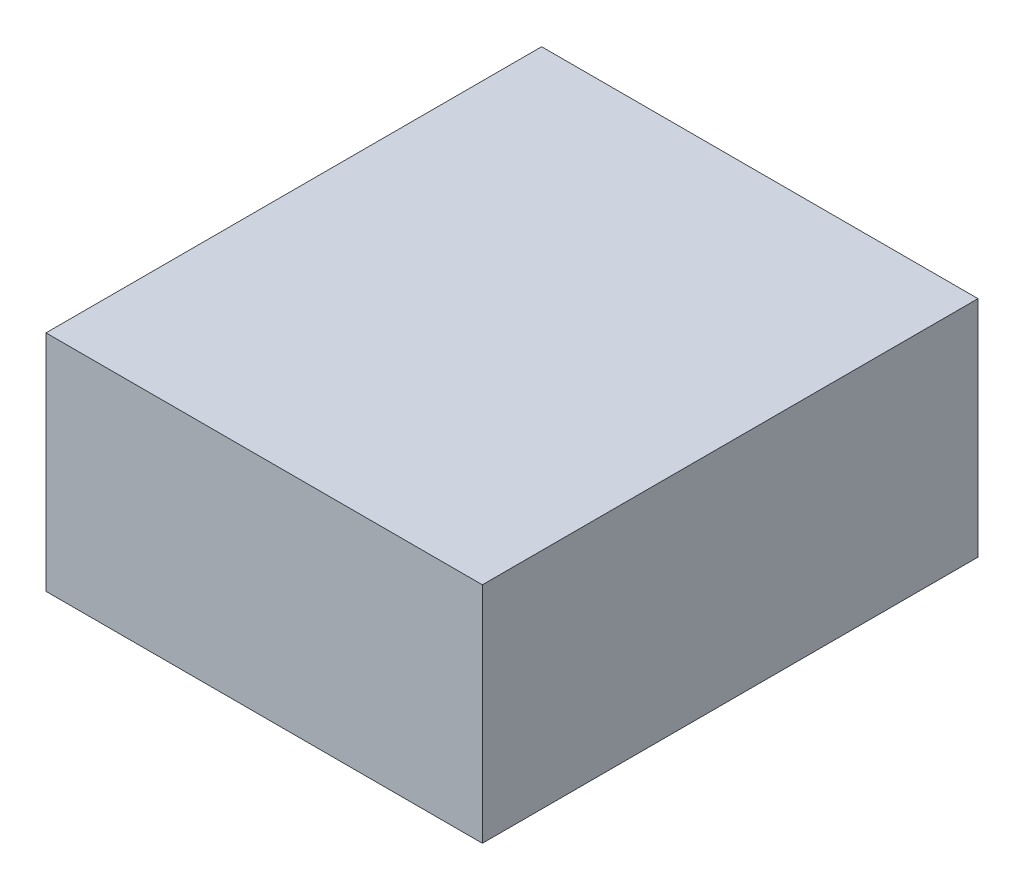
ISO-10303-21;
HEADER;
FILE_DESCRIPTION(('STEP AP214'),'2;1');
FILE_NAME('part.step','',(''),(''),'','','');
FILE_SCHEMA(('AUTOMOTIVE_DESIGN { 1 0 10303 214 1 1 1 1 }'));
ENDSEC;
DATA;
#1=APPLICATION_CONTEXT('core data for automotive mechanical design processes');
#2=APPLICATION_PROTOCOL_DEFINITION('international standard','automotive_design',2000,#1);
#3=PRODUCT_CONTEXT('',#1,'mechanical');
#4=PRODUCT('Part','Part','',(#3));
#5=PRODUCT_RELATED_PRODUCT_CATEGORY('part','',(#4));
#6=PRODUCT_DEFINITION_FORMATION('','',#4);
#7=PRODUCT_DEFINITION_CONTEXT('part definition',#1,'design');
#8=PRODUCT_DEFINITION('design','',#6,#7);
#9=PRODUCT_DEFINITION_SHAPE('','',#8);
#10=(LENGTH_UNIT() NAMED_UNIT(*) SI_UNIT(.MILLI.,.METRE.));
#11=(NAMED_UNIT(*) PLANE_ANGLE_UNIT() SI_UNIT($,.RADIAN.));
#12=(NAMED_UNIT(*) SI_UNIT($,.STERADIAN.) SOLID_ANGLE_UNIT());
#13=UNCERTAINTY_MEASURE_WITH_UNIT(LENGTH_MEASURE(1.E-05),#10,'distance_accuracy_value','');
#14=(GEOMETRIC_REPRESENTATION_CONTEXT(3) GLOBAL_UNCERTAINTY_ASSIGNED_CONTEXT((#13)) GLOBAL_UNIT_ASSIGNED_CONTEXT((#10,
#11,#12)) REPRESENTATION_CONTEXT('',''));
#15=CARTESIAN_POINT('',(0.,0.,0.));
#16=DIRECTION('',(0.,0.,1.));
#17=DIRECTION('',(1.,0.,0.));
#18=AXIS2_PLACEMENT_3D('',#15,#16,#17);
#19=CARTESIAN_POINT('',(-90.2456507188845,85.,-85.3893965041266));
#20=DIRECTION('',(-1.,0.,0.));
#21=DIRECTION('',(0.,0.,1.));
#22=AXIS2_PLACEMENT_3D('',#19,#20,#21);
#23=PLANE('',#22);
#24=DIRECTION('',(0.,0.,-1.));
#25=VECTOR('',#24,1.);
#26=CARTESIAN_POINT('',(-90.2456507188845,-5.,-85.3893965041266));
#27=LINE('',#26,#25);
#28=CARTESIAN_POINT('',(-90.2456507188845,-5.,113.858446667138));
#29=VERTEX_POINT('',#28);
#30=CARTESIAN_POINT('',(-90.2456507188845,-5.,-85.3893965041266));
#31=VERTEX_POINT('',#30);
#32=EDGE_CURVE('E547',#29,#31,#27,.T.);
#33=ORIENTED_EDGE('',*,*,#32,.F.);
#34=DIRECTION('',(0.,-1.,0.));
#35=VECTOR('',#34,1.);
#36=CARTESIAN_POINT('',(-90.2456507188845,85.,113.858446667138));
#37=LINE('',#36,#35);
#38=CARTESIAN_POINT('',(-90.2456507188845,85.,113.858446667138));
#39=VERTEX_POINT('',#38);
#40=EDGE_CURVE('E12',#39,#29,#37,.T.);
#41=ORIENTED_EDGE('',*,*,#40,.F.);
#42=DIRECTION('',(0.,0.,-1.));
#43=VECTOR('',#42,1.);
#44=CARTESIAN_POINT('',(-90.2456507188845,85.,-85.3893965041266));
#45=LINE('',#44,#43);
#46=CARTESIAN_POINT('',(-90.2456507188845,85.,-85.3893965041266));
#47=VERTEX_POINT('',#46);
#48=EDGE_CURVE('E549',#39,#47,#45,.T.);
#49=ORIENTED_EDGE('',*,*,#48,.T.);
#50=DIRECTION('',(0.,-1.,0.));
#51=VECTOR('',#50,1.);
#52=CARTESIAN_POINT('',(-90.2456507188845,85.,-85.3893965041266));
#53=LINE('',#52,#51);
#54=EDGE_CURVE('E510',#47,#31,#53,.T.);
#55=ORIENTED_EDGE('',*,*,#54,.T.);
#56=EDGE_LOOP('',(#33,#41,#49,#55));
#57=FACE_BOUND('',#56,.T.);
#58=ADVANCED_FACE('F507',(#57),#23,.T.);
#59=CARTESIAN_POINT('',(-90.2456507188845,85.,113.858446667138));
#60=DIRECTION('',(0.,0.,1.));
#61=DIRECTION('',(1.,0.,0.));
#62=AXIS2_PLACEMENT_3D('',#59,#60,#61);
#63=PLANE('',#62);
#64=DIRECTION('',(-1.,0.,0.));
#65=VECTOR('',#64,1.);
#66=CARTESIAN_POINT('',(-90.2456507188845,-5.,113.858446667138));
#67=LINE('',#66,#65);
#68=CARTESIAN_POINT('',(85.1759155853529,-5.,113.858446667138));
#69=VERTEX_POINT('',#68);
#70=EDGE_CURVE('E564',#69,#29,#67,.T.);
#71=ORIENTED_EDGE('',*,*,#70,.F.);
#72=DIRECTION('',(0.,-1.,0.));
#73=VECTOR('',#72,1.);
#74=CARTESIAN_POINT('',(85.1759155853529,85.,113.858446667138));
#75=LINE('',#74,#73);
#76=CARTESIAN_POINT('',(85.1759155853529,85.,113.858446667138));
#77=VERTEX_POINT('',#76);
#78=EDGE_CURVE('E515',#77,#69,#75,.T.);
#79=ORIENTED_EDGE('',*,*,#78,.F.);
#80=DIRECTION('',(-1.,0.,0.));
#81=VECTOR('',#80,1.);
#82=CARTESIAN_POINT('',(-90.2456507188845,85.,113.858446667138));
#83=LINE('',#82,#81);
#84=EDGE_CURVE('E554',#77,#39,#83,.T.);
#85=ORIENTED_EDGE('',*,*,#84,.T.);
#86=ORIENTED_EDGE('',*,*,#40,.T.);
#87=EDGE_LOOP('',(#71,#79,#85,#86));
#88=FACE_BOUND('',#87,.T.);
#89=ADVANCED_FACE('F579',(#88),#63,.T.);
#90=CARTESIAN_POINT('',(85.1759155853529,85.,-85.3893965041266));
#91=DIRECTION('',(1.,0.,0.));
#92=DIRECTION('',(0.,0.,-1.));
#93=AXIS2_PLACEMENT_3D('',#90,#91,#92);
#94=PLANE('',#93);
#95=DIRECTION('',(0.,0.,1.));
#96=VECTOR('',#95,1.);
#97=CARTESIAN_POINT('',(85.1759155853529,-5.,-85.3893965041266));
#98=LINE('',#97,#96);
#99=CARTESIAN_POINT('',(85.1759155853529,-5.,-85.3893965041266));
#100=VERTEX_POINT('',#99);
#101=EDGE_CURVE('E561',#100,#69,#98,.T.);
#102=ORIENTED_EDGE('',*,*,#101,.F.);
#103=DIRECTION('',(0.,-1.,0.));
#104=VECTOR('',#103,1.);
#105=CARTESIAN_POINT('',(85.1759155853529,85.,-85.3893965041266));
#106=LINE('',#105,#104);
#107=CARTESIAN_POINT('',(85.1759155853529,85.,-85.3893965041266));
#108=VERTEX_POINT('',#107);
#109=EDGE_CURVE('E553',#108,#100,#106,.T.);
#110=ORIENTED_EDGE('',*,*,#109,.F.);
#111=DIRECTION('',(0.,0.,1.));
#112=VECTOR('',#111,1.);
#113=CARTESIAN_POINT('',(85.1759155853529,85.,-85.3893965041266));
#114=LINE('',#113,#112);
#115=EDGE_CURVE('E572',#108,#77,#114,.T.);
#116=ORIENTED_EDGE('',*,*,#115,.T.);
#117=ORIENTED_EDGE('',*,*,#78,.T.);
#118=EDGE_LOOP('',(#102,#110,#116,#117));
#119=FACE_BOUND('',#118,.T.);
#120=ADVANCED_FACE('F576',(#119),#94,.T.);
#121=CARTESIAN_POINT('',(-90.2456507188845,85.,-85.3893965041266));
#122=DIRECTION('',(0.,0.,-1.));
#123=DIRECTION('',(-1.,0.,0.));
#124=AXIS2_PLACEMENT_3D('',#121,#122,#123);
#125=PLANE('',#124);
#126=DIRECTION('',(1.,0.,0.));
#127=VECTOR('',#126,1.);
#128=CARTESIAN_POINT('',(-90.2456507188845,-5.,-85.3893965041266));
#129=LINE('',#128,#127);
#130=EDGE_CURVE('E556',#31,#100,#129,.T.);
#131=ORIENTED_EDGE('',*,*,#130,.F.);
#132=ORIENTED_EDGE('',*,*,#54,.F.);
#133=DIRECTION('',(1.,0.,0.));
#134=VECTOR('',#133,1.);
#135=CARTESIAN_POINT('',(-90.2456507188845,85.,-85.3893965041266));
#136=LINE('',#135,#134);
#137=EDGE_CURVE('E570',#47,#108,#136,.T.);
#138=ORIENTED_EDGE('',*,*,#137,.T.);
#139=ORIENTED_EDGE('',*,*,#109,.T.);
#140=EDGE_LOOP('',(#131,#132,#138,#139));
#141=FACE_BOUND('',#140,.T.);
#142=ADVANCED_FACE('F557',(#141),#125,.T.);
#143=CARTESIAN_POINT('',(-90.2456507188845,85.,113.858446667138));
#144=DIRECTION('',(0.,1.,0.));
#145=DIRECTION('',(0.,0.,1.));
#146=AXIS2_PLACEMENT_3D('',#143,#144,#145);
#147=PLANE('',#146);
#148=ORIENTED_EDGE('',*,*,#48,.F.);
#149=ORIENTED_EDGE('',*,*,#84,.F.);
#150=ORIENTED_EDGE('',*,*,#115,.F.);
#151=ORIENTED_EDGE('',*,*,#137,.F.);
#152=EDGE_LOOP('',(#148,#149,#150,#151));
#153=FACE_BOUND('',#152,.T.);
#154=ADVANCED_FACE('F581',(#153),#147,.T.);
#155=CARTESIAN_POINT('',(-90.2456507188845,-5.,113.858446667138));
#156=DIRECTION('',(0.,1.,0.));
#157=DIRECTION('',(0.,0.,1.));
#158=AXIS2_PLACEMENT_3D('',#155,#156,#157);
#159=PLANE('',#158);
#160=ORIENTED_EDGE('',*,*,#32,.T.);
#161=ORIENTED_EDGE('',*,*,#130,.T.);
#162=ORIENTED_EDGE('',*,*,#101,.T.);
#163=ORIENTED_EDGE('',*,*,#70,.T.);
#164=EDGE_LOOP('',(#160,#161,#162,#163));
#165=FACE_BOUND('',#164,.T.);
#166=ADVANCED_FACE('F563',(#165),#159,.F.);
#167=CLOSED_SHELL('',(#58,#89,#120,#142,#154,#166));
#168=MANIFOLD_SOLID_BREP('B2',#167);
#169=ADVANCED_BREP_SHAPE_REPRESENTATION('',(#18,#168),#14);
#170=SHAPE_DEFINITION_REPRESENTATION(#9,#169);
ENDSEC;
END-ISO-10303-21;
